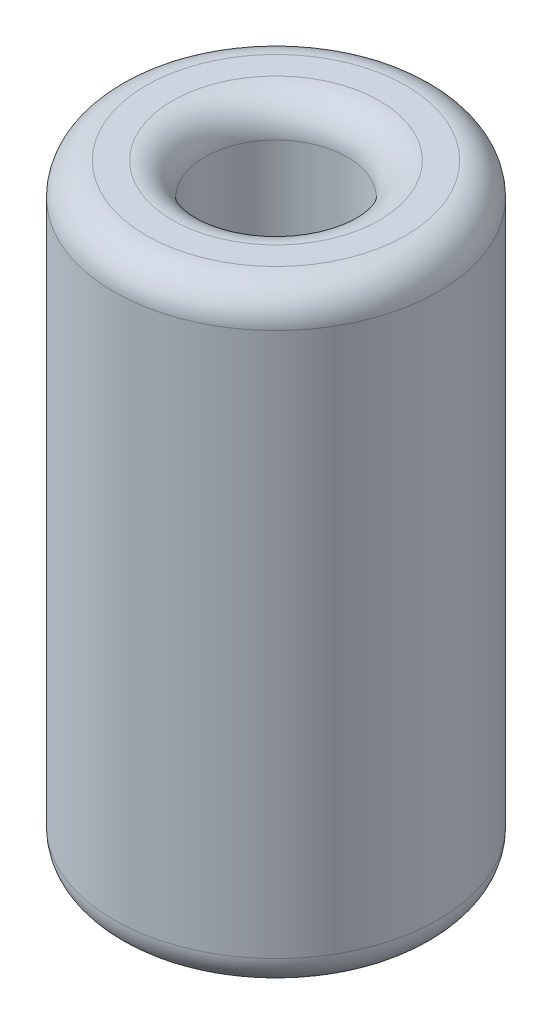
from build123d import *


with BuildPart() as part:
    # Sketch1 → Revolve1 (revolve)
    with BuildSketch(Plane.XY, mode=Mode.PRIVATE) as revolve1_sk:
        with BuildLine():
            Line((2.55, 15), (3.2, 15))
            ThreePointArc((3.2, 15), (3.765685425, 14.765685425), (4, 14.2))
            Line((4, 14.2), (4, 0.8))
            ThreePointArc((4, 0.8), (3.765685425, 0.234314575), (3.2, 0))
            Line((3.2, 0), (2.55, 0))
            ThreePointArc((2.55, 0), (1.984314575, 0.234314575), (1.75, 0.8))
            Line((1.75, 0.8), (1.75, 14.2))
            ThreePointArc((1.75, 14.2), (1.984314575, 14.765685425), (2.55, 15))
        make_face()
    revolve(revolve1_sk.sketch.rotate(Axis((0, 0, 0), (0, 1, 0)), 90), axis=Axis((0, 0, 0), (0, 1, 0)))


solid = part.part
